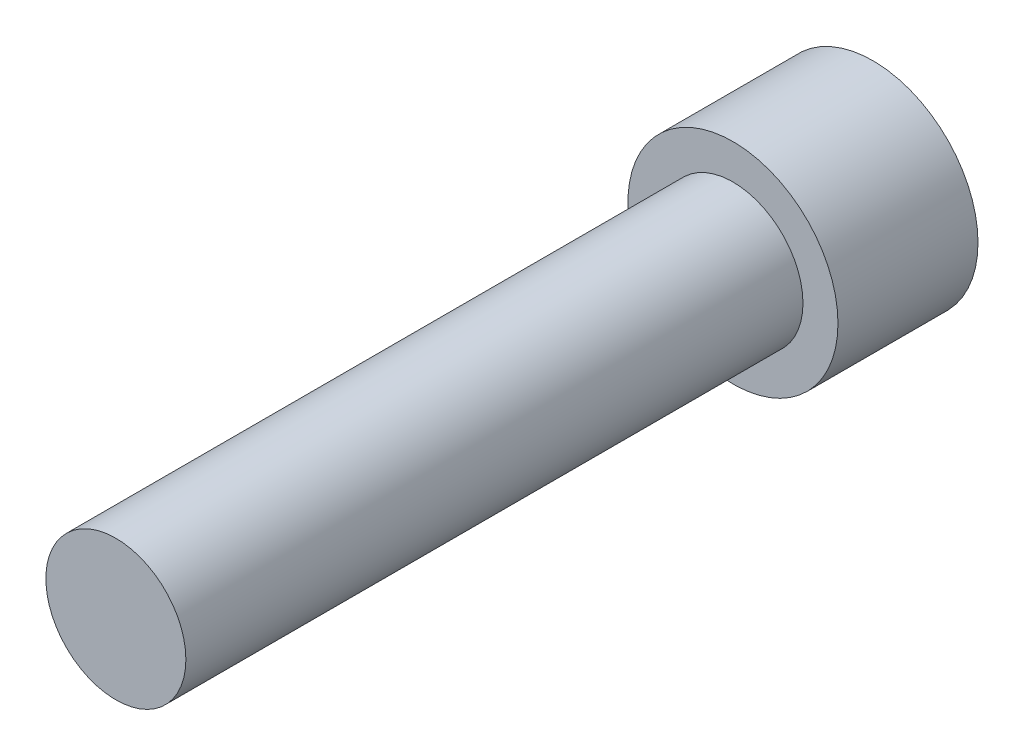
from build123d import *

# Parameters (mm, degrees)
HEX_2_DEPTH = 4.826


with BuildPart() as part:
    # Sketch6 → Revolve1 (revolve)
    with BuildSketch(Plane(origin=(0, 0, 0), x_dir=(0, 0, -1), z_dir=(1, 0, 0)), mode=Mode.PRIVATE) as revolve1_sk:
        Polygon((-34.925, 0), (-34.925, -3.9624), (0, -3.9624), (0, -5.9436), (7.9248, -5.9436), (7.9248, 0), align=None)
    revolve(revolve1_sk.sketch.rotate(Axis((0, 0, 34.925), (0, 0, -1)), 270), axis=Axis((0, 0, 34.925), (0, 0, -1)))

    # Sketch7 → HEX 2 (cut)
    with BuildSketch(Plane(origin=(0, 0, -7.9248), x_dir=(-1, 0, 0), z_dir=(0, 0, -1))):
        Polygon((-3.175, 1.833087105), (-3.175, -1.833087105), (0, -3.666174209), (3.175, -1.833087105), (3.175, 1.833087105), (0, 3.666174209), align=None)
    extrude(amount=-HEX_2_DEPTH, mode=Mode.SUBTRACT)


solid = part.part
